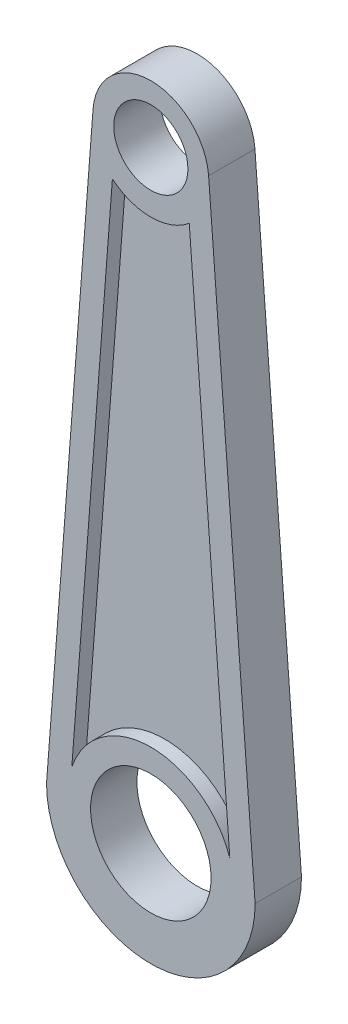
ISO-10303-21;
HEADER;
FILE_DESCRIPTION(('STEP AP214'),'2;1');
FILE_NAME('part.step','',(''),(''),'','','');
FILE_SCHEMA(('AUTOMOTIVE_DESIGN { 1 0 10303 214 1 1 1 1 }'));
ENDSEC;
DATA;
#1=APPLICATION_CONTEXT('core data for automotive mechanical design processes');
#2=APPLICATION_PROTOCOL_DEFINITION('international standard','automotive_design',2000,#1);
#3=PRODUCT_CONTEXT('',#1,'mechanical');
#4=PRODUCT('Part','Part','',(#3));
#5=PRODUCT_RELATED_PRODUCT_CATEGORY('part','',(#4));
#6=PRODUCT_DEFINITION_FORMATION('','',#4);
#7=PRODUCT_DEFINITION_CONTEXT('part definition',#1,'design');
#8=PRODUCT_DEFINITION('design','',#6,#7);
#9=PRODUCT_DEFINITION_SHAPE('','',#8);
#10=(LENGTH_UNIT() NAMED_UNIT(*) SI_UNIT(.MILLI.,.METRE.));
#11=(NAMED_UNIT(*) PLANE_ANGLE_UNIT() SI_UNIT($,.RADIAN.));
#12=(NAMED_UNIT(*) SI_UNIT($,.STERADIAN.) SOLID_ANGLE_UNIT());
#13=UNCERTAINTY_MEASURE_WITH_UNIT(LENGTH_MEASURE(1.E-05),#10,'distance_accuracy_value','');
#14=(GEOMETRIC_REPRESENTATION_CONTEXT(3) GLOBAL_UNCERTAINTY_ASSIGNED_CONTEXT((#13)) GLOBAL_UNIT_ASSIGNED_CONTEXT((#10,
#11,#12)) REPRESENTATION_CONTEXT('',''));
#15=CARTESIAN_POINT('',(0.,0.,0.));
#16=DIRECTION('',(0.,0.,1.));
#17=DIRECTION('',(1.,0.,0.));
#18=AXIS2_PLACEMENT_3D('',#15,#16,#17);
#19=CARTESIAN_POINT('',(0.,0.,0.));
#20=DIRECTION('',(0.,0.,1.));
#21=DIRECTION('',(1.,0.,0.));
#22=AXIS2_PLACEMENT_3D('',#19,#20,#21);
#23=PLANE('',#22);
#24=CARTESIAN_POINT('',(0.,130.,0.));
#25=DIRECTION('',(0.,0.,1.));
#26=DIRECTION('',(1.,0.,0.));
#27=AXIS2_PLACEMENT_3D('',#24,#25,#26);
#28=CIRCLE('',#27,8.);
#29=CARTESIAN_POINT('',(8.,130.,0.));
#30=VERTEX_POINT('',#29);
#31=EDGE_CURVE('E199',#30,#30,#28,.T.);
#32=ORIENTED_EDGE('',*,*,#31,.T.);
#33=EDGE_LOOP('',(#32));
#34=FACE_BOUND('',#33,.T.);
#35=CARTESIAN_POINT('',(0.,0.,0.));
#36=DIRECTION('',(0.,0.,1.));
#37=DIRECTION('',(1.,0.,0.));
#38=AXIS2_PLACEMENT_3D('',#35,#36,#37);
#39=CIRCLE('',#38,13.);
#40=CARTESIAN_POINT('',(13.,0.,0.));
#41=VERTEX_POINT('',#40);
#42=EDGE_CURVE('E224',#41,#41,#39,.T.);
#43=ORIENTED_EDGE('',*,*,#42,.T.);
#44=EDGE_LOOP('',(#43));
#45=FACE_BOUND('',#44,.T.);
#46=DIRECTION('',(0.076416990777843,-0.997075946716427,0.));
#47=VECTOR('',#46,1.);
#48=CARTESIAN_POINT('',(22.3686099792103,1.71435472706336,0.));
#49=LINE('',#48,#47);
#50=CARTESIAN_POINT('',(12.4634493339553,130.955212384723,0.));
#51=VERTEX_POINT('',#50);
#52=CARTESIAN_POINT('',(22.5,0.,0.));
#53=VERTEX_POINT('',#52);
#54=EDGE_CURVE('E189',#51,#53,#49,.T.);
#55=ORIENTED_EDGE('',*,*,#54,.T.);
#56=CARTESIAN_POINT('',(0.,0.,0.));
#57=DIRECTION('',(0.,0.,1.));
#58=DIRECTION('',(1.,0.,0.));
#59=AXIS2_PLACEMENT_3D('',#56,#57,#58);
#60=CIRCLE('',#59,22.5);
#61=CARTESIAN_POINT('',(-22.5,0.,0.));
#62=VERTEX_POINT('',#61);
#63=EDGE_CURVE('E221',#62,#53,#60,.T.);
#64=ORIENTED_EDGE('',*,*,#63,.F.);
#65=DIRECTION('',(0.0764169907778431,0.997075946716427,0.));
#66=VECTOR('',#65,1.);
#67=CARTESIAN_POINT('',(-22.3686099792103,1.71435472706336,0.));
#68=LINE('',#67,#66);
#69=CARTESIAN_POINT('',(-12.4634493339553,130.955212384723,0.));
#70=VERTEX_POINT('',#69);
#71=EDGE_CURVE('E218',#62,#70,#68,.T.);
#72=ORIENTED_EDGE('',*,*,#71,.T.);
#73=CARTESIAN_POINT('',(0.,130.,0.));
#74=DIRECTION('',(0.,0.,1.));
#75=DIRECTION('',(1.,0.,0.));
#76=AXIS2_PLACEMENT_3D('',#73,#74,#75);
#77=CIRCLE('',#76,12.5);
#78=EDGE_CURVE('E215',#51,#70,#77,.T.);
#79=ORIENTED_EDGE('',*,*,#78,.F.);
#80=EDGE_LOOP('',(#55,#64,#72,#79));
#81=FACE_BOUND('',#80,.T.);
#82=CARTESIAN_POINT('',(0.,0.,0.));
#83=DIRECTION('',(0.,0.,-1.));
#84=DIRECTION('',(1.,0.,0.));
#85=AXIS2_PLACEMENT_3D('',#82,#83,#84);
#86=CIRCLE('',#85,18.);
#87=CARTESIAN_POINT('',(-17.0410701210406,5.79671709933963,0.));
#88=VERTEX_POINT('',#87);
#89=CARTESIAN_POINT('',(17.0410701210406,5.7967170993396,0.));
#90=VERTEX_POINT('',#89);
#91=EDGE_CURVE('E53',#88,#90,#86,.T.);
#92=ORIENTED_EDGE('',*,*,#91,.T.);
#93=DIRECTION('',(-0.076416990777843,0.997075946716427,0.));
#94=VECTOR('',#93,1.);
#95=CARTESIAN_POINT('',(17.0410701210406,5.7967170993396,0.));
#96=LINE('',#95,#94);
#97=CARTESIAN_POINT('',(8.28949426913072,119.985795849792,0.));
#98=VERTEX_POINT('',#97);
#99=EDGE_CURVE('E146',#90,#98,#96,.T.);
#100=ORIENTED_EDGE('',*,*,#99,.T.);
#101=CARTESIAN_POINT('',(0.,130.,0.));
#102=DIRECTION('',(0.,0.,-1.));
#103=DIRECTION('',(1.,0.,0.));
#104=AXIS2_PLACEMENT_3D('',#101,#102,#103);
#105=CIRCLE('',#104,13.);
#106=CARTESIAN_POINT('',(-8.28949426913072,119.985795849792,0.));
#107=VERTEX_POINT('',#106);
#108=EDGE_CURVE('E149',#98,#107,#105,.T.);
#109=ORIENTED_EDGE('',*,*,#108,.T.);
#110=DIRECTION('',(-0.076416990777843,-0.997075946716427,0.));
#111=VECTOR('',#110,1.);
#112=CARTESIAN_POINT('',(-8.28949426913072,119.985795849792,0.));
#113=LINE('',#112,#111);
#114=EDGE_CURVE('E155',#107,#88,#113,.T.);
#115=ORIENTED_EDGE('',*,*,#114,.T.);
#116=EDGE_LOOP('',(#92,#100,#109,#115));
#117=FACE_BOUND('',#116,.T.);
#118=ADVANCED_FACE('F38',(#34,#45,#81,#117),#23,.F.);
#119=CARTESIAN_POINT('',(22.3686099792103,1.71435472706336,10.));
#120=DIRECTION('',(0.997075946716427,0.076416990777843,0.));
#121=DIRECTION('',(-0.076416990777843,0.997075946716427,0.));
#122=AXIS2_PLACEMENT_3D('',#119,#120,#121);
#123=PLANE('',#122);
#124=ORIENTED_EDGE('',*,*,#54,.F.);
#125=DIRECTION('',(0.,0.,-1.));
#126=VECTOR('',#125,1.);
#127=CARTESIAN_POINT('',(12.4634493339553,130.955212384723,10.));
#128=LINE('',#127,#126);
#129=CARTESIAN_POINT('',(12.4634493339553,130.955212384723,10.));
#130=VERTEX_POINT('',#129);
#131=EDGE_CURVE('E11',#130,#51,#128,.T.);
#132=ORIENTED_EDGE('',*,*,#131,.F.);
#133=DIRECTION('',(0.076416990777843,-0.997075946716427,0.));
#134=VECTOR('',#133,1.);
#135=CARTESIAN_POINT('',(22.3686099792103,1.71435472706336,10.));
#136=LINE('',#135,#134);
#137=CARTESIAN_POINT('',(22.5,0.,10.));
#138=VERTEX_POINT('',#137);
#139=EDGE_CURVE('E195',#130,#138,#136,.T.);
#140=ORIENTED_EDGE('',*,*,#139,.T.);
#141=DIRECTION('',(0.,0.,-1.));
#142=VECTOR('',#141,1.);
#143=CARTESIAN_POINT('',(22.5,0.,10.));
#144=LINE('',#143,#142);
#145=EDGE_CURVE('E212',#138,#53,#144,.T.);
#146=ORIENTED_EDGE('',*,*,#145,.T.);
#147=EDGE_LOOP('',(#124,#132,#140,#146));
#148=FACE_BOUND('',#147,.T.);
#149=ADVANCED_FACE('F40',(#148),#123,.T.);
#150=CARTESIAN_POINT('',(0.,130.,10.));
#151=DIRECTION('',(0.,0.,-1.));
#152=DIRECTION('',(-1.,0.,0.));
#153=AXIS2_PLACEMENT_3D('',#150,#151,#152);
#154=CYLINDRICAL_SURFACE('',#153,12.5);
#155=ORIENTED_EDGE('',*,*,#78,.T.);
#156=DIRECTION('',(0.,0.,-1.));
#157=VECTOR('',#156,1.);
#158=CARTESIAN_POINT('',(-12.4634493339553,130.955212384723,10.));
#159=LINE('',#158,#157);
#160=CARTESIAN_POINT('',(-12.4634493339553,130.955212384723,10.));
#161=VERTEX_POINT('',#160);
#162=EDGE_CURVE('E46',#161,#70,#159,.T.);
#163=ORIENTED_EDGE('',*,*,#162,.F.);
#164=CARTESIAN_POINT('',(0.,130.,10.));
#165=DIRECTION('',(0.,0.,1.));
#166=DIRECTION('',(1.,0.,0.));
#167=AXIS2_PLACEMENT_3D('',#164,#165,#166);
#168=CIRCLE('',#167,12.5);
#169=EDGE_CURVE('E198',#130,#161,#168,.T.);
#170=ORIENTED_EDGE('',*,*,#169,.F.);
#171=ORIENTED_EDGE('',*,*,#131,.T.);
#172=EDGE_LOOP('',(#155,#163,#170,#171));
#173=FACE_BOUND('',#172,.T.);
#174=ADVANCED_FACE('F239',(#173),#154,.T.);
#175=CARTESIAN_POINT('',(-22.3686099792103,1.71435472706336,10.));
#176=DIRECTION('',(-0.997075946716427,0.0764169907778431,0.));
#177=DIRECTION('',(-0.0764169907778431,-0.997075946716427,0.));
#178=AXIS2_PLACEMENT_3D('',#175,#176,#177);
#179=PLANE('',#178);
#180=ORIENTED_EDGE('',*,*,#71,.F.);
#181=DIRECTION('',(0.,0.,-1.));
#182=VECTOR('',#181,1.);
#183=CARTESIAN_POINT('',(-22.5,0.,10.));
#184=LINE('',#183,#182);
#185=CARTESIAN_POINT('',(-22.5,0.,10.));
#186=VERTEX_POINT('',#185);
#187=EDGE_CURVE('E230',#186,#62,#184,.T.);
#188=ORIENTED_EDGE('',*,*,#187,.F.);
#189=DIRECTION('',(0.0764169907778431,0.997075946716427,0.));
#190=VECTOR('',#189,1.);
#191=CARTESIAN_POINT('',(-22.3686099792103,1.71435472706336,10.));
#192=LINE('',#191,#190);
#193=EDGE_CURVE('E201',#186,#161,#192,.T.);
#194=ORIENTED_EDGE('',*,*,#193,.T.);
#195=ORIENTED_EDGE('',*,*,#162,.T.);
#196=EDGE_LOOP('',(#180,#188,#194,#195));
#197=FACE_BOUND('',#196,.T.);
#198=ADVANCED_FACE('F234',(#197),#179,.T.);
#199=CARTESIAN_POINT('',(0.,0.,10.));
#200=DIRECTION('',(0.,0.,-1.));
#201=DIRECTION('',(-1.,0.,0.));
#202=AXIS2_PLACEMENT_3D('',#199,#200,#201);
#203=CYLINDRICAL_SURFACE('',#202,13.);
#204=CARTESIAN_POINT('',(0.,0.,10.));
#205=DIRECTION('',(0.,0.,1.));
#206=DIRECTION('',(1.,0.,0.));
#207=AXIS2_PLACEMENT_3D('',#204,#205,#206);
#208=CIRCLE('',#207,13.);
#209=CARTESIAN_POINT('',(13.,0.,10.));
#210=VERTEX_POINT('',#209);
#211=EDGE_CURVE('E206',#210,#210,#208,.T.);
#212=ORIENTED_EDGE('',*,*,#211,.T.);
#213=EDGE_LOOP('',(#212));
#214=FACE_BOUND('',#213,.T.);
#215=ORIENTED_EDGE('',*,*,#42,.F.);
#216=EDGE_LOOP('',(#215));
#217=FACE_BOUND('',#216,.T.);
#218=ADVANCED_FACE('F270',(#214,#217),#203,.F.);
#219=CARTESIAN_POINT('',(0.,0.,10.));
#220=DIRECTION('',(0.,0.,-1.));
#221=DIRECTION('',(-1.,0.,0.));
#222=AXIS2_PLACEMENT_3D('',#219,#220,#221);
#223=CYLINDRICAL_SURFACE('',#222,22.5);
#224=ORIENTED_EDGE('',*,*,#63,.T.);
#225=ORIENTED_EDGE('',*,*,#145,.F.);
#226=CARTESIAN_POINT('',(0.,0.,10.));
#227=DIRECTION('',(0.,0.,1.));
#228=DIRECTION('',(1.,0.,0.));
#229=AXIS2_PLACEMENT_3D('',#226,#227,#228);
#230=CIRCLE('',#229,22.5);
#231=EDGE_CURVE('E204',#186,#138,#230,.T.);
#232=ORIENTED_EDGE('',*,*,#231,.F.);
#233=ORIENTED_EDGE('',*,*,#187,.T.);
#234=EDGE_LOOP('',(#224,#225,#232,#233));
#235=FACE_BOUND('',#234,.T.);
#236=ADVANCED_FACE('F246',(#235),#223,.T.);
#237=CARTESIAN_POINT('',(0.,130.,10.));
#238=DIRECTION('',(0.,0.,-1.));
#239=DIRECTION('',(-1.,0.,0.));
#240=AXIS2_PLACEMENT_3D('',#237,#238,#239);
#241=CYLINDRICAL_SURFACE('',#240,8.);
#242=CARTESIAN_POINT('',(0.,130.,10.));
#243=DIRECTION('',(0.,0.,1.));
#244=DIRECTION('',(1.,0.,0.));
#245=AXIS2_PLACEMENT_3D('',#242,#243,#244);
#246=CIRCLE('',#245,8.);
#247=CARTESIAN_POINT('',(8.,130.,10.));
#248=VERTEX_POINT('',#247);
#249=EDGE_CURVE('E209',#248,#248,#246,.T.);
#250=ORIENTED_EDGE('',*,*,#249,.T.);
#251=EDGE_LOOP('',(#250));
#252=FACE_BOUND('',#251,.T.);
#253=ORIENTED_EDGE('',*,*,#31,.F.);
#254=EDGE_LOOP('',(#253));
#255=FACE_BOUND('',#254,.T.);
#256=ADVANCED_FACE('F266',(#252,#255),#241,.F.);
#257=CARTESIAN_POINT('',(0.,0.,10.));
#258=DIRECTION('',(0.,0.,1.));
#259=DIRECTION('',(1.,0.,0.));
#260=AXIS2_PLACEMENT_3D('',#257,#258,#259);
#261=PLANE('',#260);
#262=CARTESIAN_POINT('',(0.,0.,10.));
#263=DIRECTION('',(0.,0.,-1.));
#264=DIRECTION('',(1.,0.,0.));
#265=AXIS2_PLACEMENT_3D('',#262,#263,#264);
#266=CIRCLE('',#265,18.);
#267=CARTESIAN_POINT('',(-17.0410701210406,5.79671709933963,10.));
#268=VERTEX_POINT('',#267);
#269=CARTESIAN_POINT('',(17.0410701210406,5.7967170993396,10.));
#270=VERTEX_POINT('',#269);
#271=EDGE_CURVE('E61',#268,#270,#266,.T.);
#272=ORIENTED_EDGE('',*,*,#271,.F.);
#273=DIRECTION('',(-0.076416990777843,-0.997075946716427,0.));
#274=VECTOR('',#273,1.);
#275=CARTESIAN_POINT('',(-8.28949426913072,119.985795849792,10.));
#276=LINE('',#275,#274);
#277=CARTESIAN_POINT('',(-8.28949426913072,119.985795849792,10.));
#278=VERTEX_POINT('',#277);
#279=EDGE_CURVE('E168',#278,#268,#276,.T.);
#280=ORIENTED_EDGE('',*,*,#279,.F.);
#281=CARTESIAN_POINT('',(0.,130.,10.));
#282=DIRECTION('',(0.,0.,-1.));
#283=DIRECTION('',(1.,0.,0.));
#284=AXIS2_PLACEMENT_3D('',#281,#282,#283);
#285=CIRCLE('',#284,13.);
#286=CARTESIAN_POINT('',(8.28949426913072,119.985795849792,10.));
#287=VERTEX_POINT('',#286);
#288=EDGE_CURVE('E182',#287,#278,#285,.T.);
#289=ORIENTED_EDGE('',*,*,#288,.F.);
#290=DIRECTION('',(-0.076416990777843,0.997075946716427,0.));
#291=VECTOR('',#290,1.);
#292=CARTESIAN_POINT('',(17.0410701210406,5.7967170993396,10.));
#293=LINE('',#292,#291);
#294=EDGE_CURVE('E179',#270,#287,#293,.T.);
#295=ORIENTED_EDGE('',*,*,#294,.F.);
#296=EDGE_LOOP('',(#272,#280,#289,#295));
#297=FACE_BOUND('',#296,.T.);
#298=ORIENTED_EDGE('',*,*,#139,.F.);
#299=ORIENTED_EDGE('',*,*,#169,.T.);
#300=ORIENTED_EDGE('',*,*,#193,.F.);
#301=ORIENTED_EDGE('',*,*,#231,.T.);
#302=EDGE_LOOP('',(#298,#299,#300,#301));
#303=FACE_BOUND('',#302,.T.);
#304=ORIENTED_EDGE('',*,*,#211,.F.);
#305=EDGE_LOOP('',(#304));
#306=FACE_BOUND('',#305,.T.);
#307=ORIENTED_EDGE('',*,*,#249,.F.);
#308=EDGE_LOOP('',(#307));
#309=FACE_BOUND('',#308,.T.);
#310=ADVANCED_FACE('F250',(#297,#303,#306,#309),#261,.T.);
#311=CARTESIAN_POINT('',(0.,0.,7.));
#312=DIRECTION('',(0.,0.,1.));
#313=DIRECTION('',(1.,0.,0.));
#314=AXIS2_PLACEMENT_3D('',#311,#312,#313);
#315=CYLINDRICAL_SURFACE('',#314,18.);
#316=ORIENTED_EDGE('',*,*,#271,.T.);
#317=DIRECTION('',(0.,0.,1.));
#318=VECTOR('',#317,1.);
#319=CARTESIAN_POINT('',(17.0410701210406,5.7967170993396,7.));
#320=LINE('',#319,#318);
#321=CARTESIAN_POINT('',(17.0410701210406,5.7967170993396,7.));
#322=VERTEX_POINT('',#321);
#323=EDGE_CURVE('E177',#322,#270,#320,.T.);
#324=ORIENTED_EDGE('',*,*,#323,.F.);
#325=CARTESIAN_POINT('',(0.,0.,7.));
#326=DIRECTION('',(0.,0.,-1.));
#327=DIRECTION('',(1.,0.,0.));
#328=AXIS2_PLACEMENT_3D('',#325,#326,#327);
#329=CIRCLE('',#328,18.);
#330=CARTESIAN_POINT('',(-17.0410701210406,5.79671709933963,7.));
#331=VERTEX_POINT('',#330);
#332=EDGE_CURVE('E164',#331,#322,#329,.T.);
#333=ORIENTED_EDGE('',*,*,#332,.F.);
#334=DIRECTION('',(0.,0.,1.));
#335=VECTOR('',#334,1.);
#336=CARTESIAN_POINT('',(-17.0410701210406,5.79671709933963,7.));
#337=LINE('',#336,#335);
#338=EDGE_CURVE('E187',#331,#268,#337,.T.);
#339=ORIENTED_EDGE('',*,*,#338,.T.);
#340=EDGE_LOOP('',(#316,#324,#333,#339));
#341=FACE_BOUND('',#340,.T.);
#342=ADVANCED_FACE('F299',(#341),#315,.T.);
#343=CARTESIAN_POINT('',(-8.28949426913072,119.985795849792,7.));
#344=DIRECTION('',(-0.997075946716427,0.076416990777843,0.));
#345=DIRECTION('',(-0.076416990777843,-0.997075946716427,0.));
#346=AXIS2_PLACEMENT_3D('',#343,#344,#345);
#347=PLANE('',#346);
#348=ORIENTED_EDGE('',*,*,#279,.T.);
#349=ORIENTED_EDGE('',*,*,#338,.F.);
#350=DIRECTION('',(-0.076416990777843,-0.997075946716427,0.));
#351=VECTOR('',#350,1.);
#352=CARTESIAN_POINT('',(-8.28949426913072,119.985795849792,7.));
#353=LINE('',#352,#351);
#354=CARTESIAN_POINT('',(-8.28949426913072,119.985795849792,7.));
#355=VERTEX_POINT('',#354);
#356=EDGE_CURVE('E174',#355,#331,#353,.T.);
#357=ORIENTED_EDGE('',*,*,#356,.F.);
#358=DIRECTION('',(0.,0.,1.));
#359=VECTOR('',#358,1.);
#360=CARTESIAN_POINT('',(-8.28949426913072,119.985795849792,7.));
#361=LINE('',#360,#359);
#362=EDGE_CURVE('E190',#355,#278,#361,.T.);
#363=ORIENTED_EDGE('',*,*,#362,.T.);
#364=EDGE_LOOP('',(#348,#349,#357,#363));
#365=FACE_BOUND('',#364,.T.);
#366=ADVANCED_FACE('F306',(#365),#347,.F.);
#367=CARTESIAN_POINT('',(0.,130.,7.));
#368=DIRECTION('',(0.,0.,1.));
#369=DIRECTION('',(1.,0.,0.));
#370=AXIS2_PLACEMENT_3D('',#367,#368,#369);
#371=CYLINDRICAL_SURFACE('',#370,13.);
#372=ORIENTED_EDGE('',*,*,#288,.T.);
#373=ORIENTED_EDGE('',*,*,#362,.F.);
#374=CARTESIAN_POINT('',(0.,130.,7.));
#375=DIRECTION('',(0.,0.,-1.));
#376=DIRECTION('',(1.,0.,0.));
#377=AXIS2_PLACEMENT_3D('',#374,#375,#376);
#378=CIRCLE('',#377,13.);
#379=CARTESIAN_POINT('',(8.28949426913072,119.985795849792,7.));
#380=VERTEX_POINT('',#379);
#381=EDGE_CURVE('E171',#380,#355,#378,.T.);
#382=ORIENTED_EDGE('',*,*,#381,.F.);
#383=DIRECTION('',(0.,0.,1.));
#384=VECTOR('',#383,1.);
#385=CARTESIAN_POINT('',(8.28949426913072,119.985795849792,7.));
#386=LINE('',#385,#384);
#387=EDGE_CURVE('E192',#380,#287,#386,.T.);
#388=ORIENTED_EDGE('',*,*,#387,.T.);
#389=EDGE_LOOP('',(#372,#373,#382,#388));
#390=FACE_BOUND('',#389,.T.);
#391=ADVANCED_FACE('F312',(#390),#371,.T.);
#392=CARTESIAN_POINT('',(17.0410701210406,5.7967170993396,7.));
#393=DIRECTION('',(0.997075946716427,0.076416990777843,0.));
#394=DIRECTION('',(-0.076416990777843,0.997075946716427,0.));
#395=AXIS2_PLACEMENT_3D('',#392,#393,#394);
#396=PLANE('',#395);
#397=ORIENTED_EDGE('',*,*,#294,.T.);
#398=ORIENTED_EDGE('',*,*,#387,.F.);
#399=DIRECTION('',(-0.076416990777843,0.997075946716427,0.));
#400=VECTOR('',#399,1.);
#401=CARTESIAN_POINT('',(17.0410701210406,5.7967170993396,7.));
#402=LINE('',#401,#400);
#403=EDGE_CURVE('E167',#322,#380,#402,.T.);
#404=ORIENTED_EDGE('',*,*,#403,.F.);
#405=ORIENTED_EDGE('',*,*,#323,.T.);
#406=EDGE_LOOP('',(#397,#398,#404,#405));
#407=FACE_BOUND('',#406,.T.);
#408=ADVANCED_FACE('F320',(#407),#396,.F.);
#409=CARTESIAN_POINT('',(0.,0.,7.));
#410=DIRECTION('',(0.,0.,1.));
#411=DIRECTION('',(1.,0.,0.));
#412=AXIS2_PLACEMENT_3D('',#409,#410,#411);
#413=PLANE('',#412);
#414=ORIENTED_EDGE('',*,*,#332,.T.);
#415=ORIENTED_EDGE('',*,*,#403,.T.);
#416=ORIENTED_EDGE('',*,*,#381,.T.);
#417=ORIENTED_EDGE('',*,*,#356,.T.);
#418=EDGE_LOOP('',(#414,#415,#416,#417));
#419=FACE_BOUND('',#418,.T.);
#420=ADVANCED_FACE('F328',(#419),#413,.T.);
#421=CARTESIAN_POINT('',(0.,0.,3.));
#422=DIRECTION('',(0.,0.,-1.));
#423=DIRECTION('',(-1.,0.,0.));
#424=AXIS2_PLACEMENT_3D('',#421,#422,#423);
#425=CYLINDRICAL_SURFACE('',#424,18.);
#426=ORIENTED_EDGE('',*,*,#91,.F.);
#427=DIRECTION('',(0.,0.,-1.));
#428=VECTOR('',#427,1.);
#429=CARTESIAN_POINT('',(-17.0410701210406,5.79671709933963,3.));
#430=LINE('',#429,#428);
#431=CARTESIAN_POINT('',(-17.0410701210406,5.79671709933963,3.));
#432=VERTEX_POINT('',#431);
#433=EDGE_CURVE('E131',#432,#88,#430,.T.);
#434=ORIENTED_EDGE('',*,*,#433,.F.);
#435=CARTESIAN_POINT('',(0.,0.,3.));
#436=DIRECTION('',(0.,0.,-1.));
#437=DIRECTION('',(1.,0.,0.));
#438=AXIS2_PLACEMENT_3D('',#435,#436,#437);
#439=CIRCLE('',#438,18.);
#440=CARTESIAN_POINT('',(17.0410701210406,5.7967170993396,3.));
#441=VERTEX_POINT('',#440);
#442=EDGE_CURVE('E138',#432,#441,#439,.T.);
#443=ORIENTED_EDGE('',*,*,#442,.T.);
#444=DIRECTION('',(0.,0.,-1.));
#445=VECTOR('',#444,1.);
#446=CARTESIAN_POINT('',(17.0410701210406,5.7967170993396,3.));
#447=LINE('',#446,#445);
#448=EDGE_CURVE('E159',#441,#90,#447,.T.);
#449=ORIENTED_EDGE('',*,*,#448,.T.);
#450=EDGE_LOOP('',(#426,#434,#443,#449));
#451=FACE_BOUND('',#450,.T.);
#452=ADVANCED_FACE('F141',(#451),#425,.T.);
#453=CARTESIAN_POINT('',(17.0410701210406,5.7967170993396,3.));
#454=DIRECTION('',(-0.997075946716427,-0.076416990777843,0.));
#455=DIRECTION('',(0.076416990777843,-0.997075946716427,0.));
#456=AXIS2_PLACEMENT_3D('',#453,#454,#455);
#457=PLANE('',#456);
#458=ORIENTED_EDGE('',*,*,#99,.F.);
#459=ORIENTED_EDGE('',*,*,#448,.F.);
#460=DIRECTION('',(-0.076416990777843,0.997075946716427,0.));
#461=VECTOR('',#460,1.);
#462=CARTESIAN_POINT('',(17.0410701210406,5.7967170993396,3.));
#463=LINE('',#462,#461);
#464=CARTESIAN_POINT('',(8.28949426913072,119.985795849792,3.));
#465=VERTEX_POINT('',#464);
#466=EDGE_CURVE('E143',#441,#465,#463,.T.);
#467=ORIENTED_EDGE('',*,*,#466,.T.);
#468=DIRECTION('',(0.,0.,-1.));
#469=VECTOR('',#468,1.);
#470=CARTESIAN_POINT('',(8.28949426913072,119.985795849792,3.));
#471=LINE('',#470,#469);
#472=EDGE_CURVE('E161',#465,#98,#471,.T.);
#473=ORIENTED_EDGE('',*,*,#472,.T.);
#474=EDGE_LOOP('',(#458,#459,#467,#473));
#475=FACE_BOUND('',#474,.T.);
#476=ADVANCED_FACE('F343',(#475),#457,.T.);
#477=CARTESIAN_POINT('',(0.,130.,3.));
#478=DIRECTION('',(0.,0.,-1.));
#479=DIRECTION('',(-1.,0.,0.));
#480=AXIS2_PLACEMENT_3D('',#477,#478,#479);
#481=CYLINDRICAL_SURFACE('',#480,13.);
#482=ORIENTED_EDGE('',*,*,#108,.F.);
#483=ORIENTED_EDGE('',*,*,#472,.F.);
#484=CARTESIAN_POINT('',(0.,130.,3.));
#485=DIRECTION('',(0.,0.,-1.));
#486=DIRECTION('',(1.,0.,0.));
#487=AXIS2_PLACEMENT_3D('',#484,#485,#486);
#488=CIRCLE('',#487,13.);
#489=CARTESIAN_POINT('',(-8.28949426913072,119.985795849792,3.));
#490=VERTEX_POINT('',#489);
#491=EDGE_CURVE('E137',#465,#490,#488,.T.);
#492=ORIENTED_EDGE('',*,*,#491,.T.);
#493=DIRECTION('',(0.,0.,-1.));
#494=VECTOR('',#493,1.);
#495=CARTESIAN_POINT('',(-8.28949426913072,119.985795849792,3.));
#496=LINE('',#495,#494);
#497=EDGE_CURVE('E133',#490,#107,#496,.T.);
#498=ORIENTED_EDGE('',*,*,#497,.T.);
#499=EDGE_LOOP('',(#482,#483,#492,#498));
#500=FACE_BOUND('',#499,.T.);
#501=ADVANCED_FACE('F350',(#500),#481,.T.);
#502=CARTESIAN_POINT('',(-8.28949426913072,119.985795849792,3.));
#503=DIRECTION('',(0.997075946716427,-0.076416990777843,0.));
#504=DIRECTION('',(0.076416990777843,0.997075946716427,0.));
#505=AXIS2_PLACEMENT_3D('',#502,#503,#504);
#506=PLANE('',#505);
#507=ORIENTED_EDGE('',*,*,#114,.F.);
#508=ORIENTED_EDGE('',*,*,#497,.F.);
#509=DIRECTION('',(-0.076416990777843,-0.997075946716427,0.));
#510=VECTOR('',#509,1.);
#511=CARTESIAN_POINT('',(-8.28949426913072,119.985795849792,3.));
#512=LINE('',#511,#510);
#513=EDGE_CURVE('E128',#490,#432,#512,.T.);
#514=ORIENTED_EDGE('',*,*,#513,.T.);
#515=ORIENTED_EDGE('',*,*,#433,.T.);
#516=EDGE_LOOP('',(#507,#508,#514,#515));
#517=FACE_BOUND('',#516,.T.);
#518=ADVANCED_FACE('F130',(#517),#506,.T.);
#519=CARTESIAN_POINT('',(0.,0.,3.));
#520=DIRECTION('',(0.,0.,-1.));
#521=DIRECTION('',(1.,0.,0.));
#522=AXIS2_PLACEMENT_3D('',#519,#520,#521);
#523=PLANE('',#522);
#524=ORIENTED_EDGE('',*,*,#442,.F.);
#525=ORIENTED_EDGE('',*,*,#513,.F.);
#526=ORIENTED_EDGE('',*,*,#491,.F.);
#527=ORIENTED_EDGE('',*,*,#466,.F.);
#528=EDGE_LOOP('',(#524,#525,#526,#527));
#529=FACE_BOUND('',#528,.T.);
#530=ADVANCED_FACE('F145',(#529),#523,.T.);
#531=CLOSED_SHELL('',(#118,#149,#174,#198,#218,#236,#256,#310,#342,#366,#391,#408,#420,#452,
#476,#501,#518,#530));
#532=MANIFOLD_SOLID_BREP('B2',#531);
#533=ADVANCED_BREP_SHAPE_REPRESENTATION('',(#18,#532),#14);
#534=SHAPE_DEFINITION_REPRESENTATION(#9,#533);
ENDSEC;
END-ISO-10303-21;
